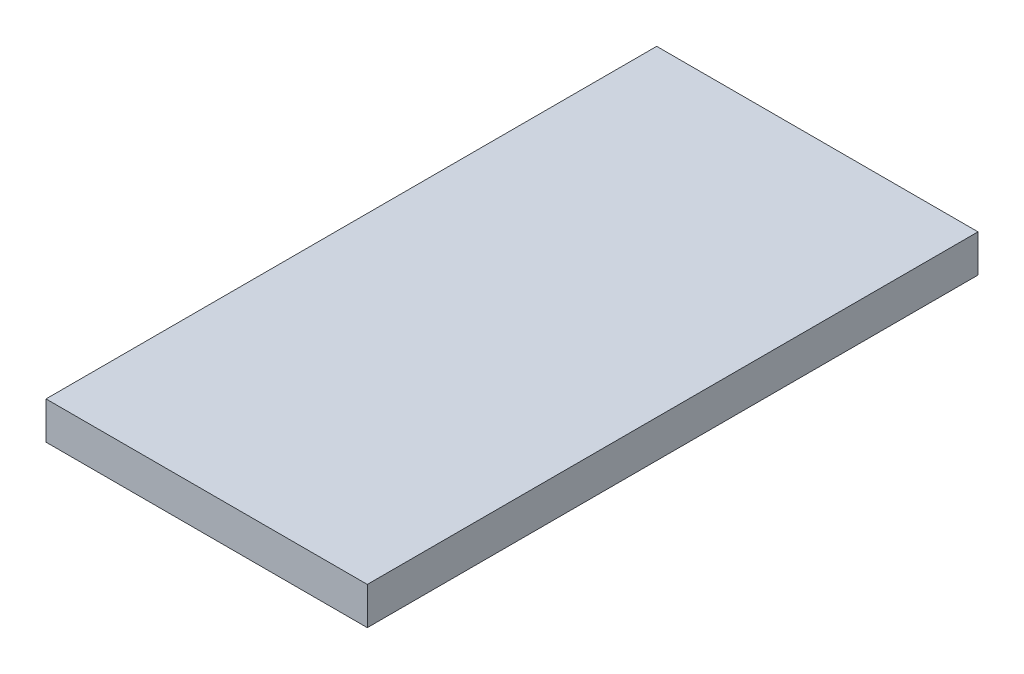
from build123d import *

# Parameters (mm, degrees)
ESQUISSE1_W        = 231.5
ESQUISSE1_H        = 27
BOSS_EXTRU_1_DEPTH = 440


with BuildPart() as part:
    # Esquisse1 → Boss.-Extru.1 (new body)
    with BuildSketch(Plane.XY):
        with Locations((334.25, 205)):
            Rectangle(ESQUISSE1_W, ESQUISSE1_H)
    extrude(amount=BOSS_EXTRU_1_DEPTH)


solid = part.part
